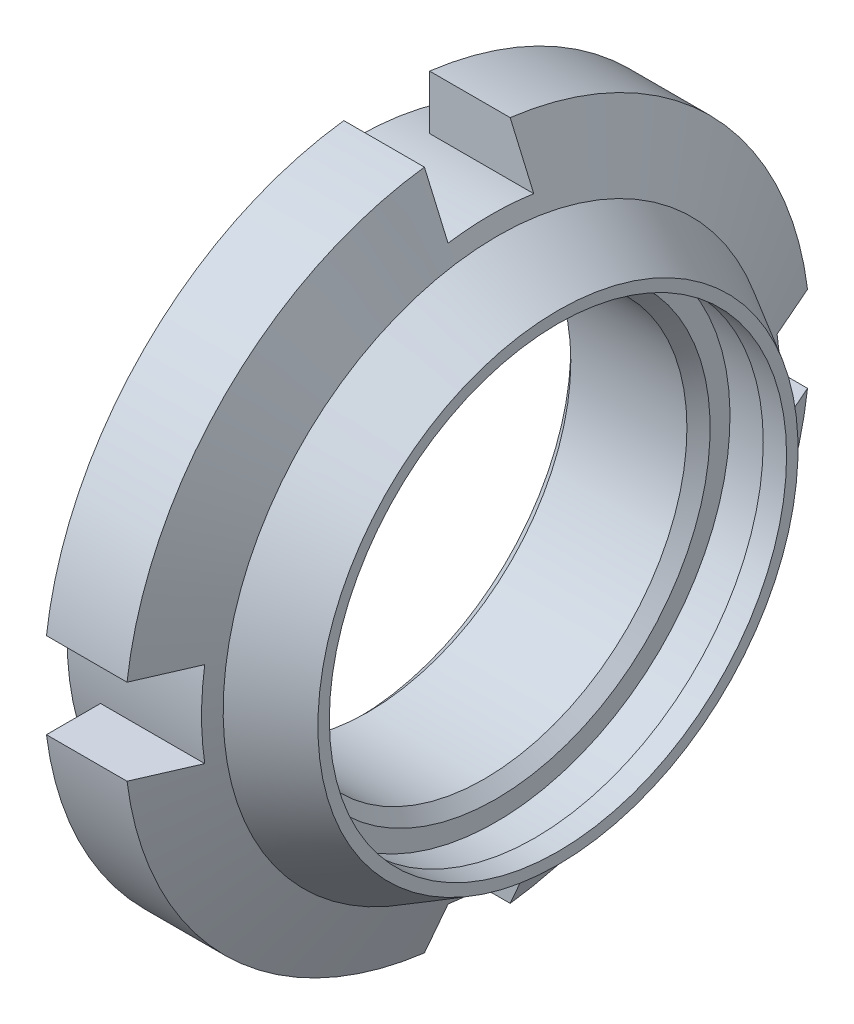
ISO-10303-21;
HEADER;
FILE_DESCRIPTION(('STEP AP214'),'2;1');
FILE_NAME('part.step','',(''),(''),'','','');
FILE_SCHEMA(('AUTOMOTIVE_DESIGN { 1 0 10303 214 1 1 1 1 }'));
ENDSEC;
DATA;
#1=APPLICATION_CONTEXT('core data for automotive mechanical design processes');
#2=APPLICATION_PROTOCOL_DEFINITION('international standard','automotive_design',2000,#1);
#3=PRODUCT_CONTEXT('',#1,'mechanical');
#4=PRODUCT('Part','Part','',(#3));
#5=PRODUCT_RELATED_PRODUCT_CATEGORY('part','',(#4));
#6=PRODUCT_DEFINITION_FORMATION('','',#4);
#7=PRODUCT_DEFINITION_CONTEXT('part definition',#1,'design');
#8=PRODUCT_DEFINITION('design','',#6,#7);
#9=PRODUCT_DEFINITION_SHAPE('','',#8);
#10=(LENGTH_UNIT() NAMED_UNIT(*) SI_UNIT(.MILLI.,.METRE.));
#11=(NAMED_UNIT(*) PLANE_ANGLE_UNIT() SI_UNIT($,.RADIAN.));
#12=(NAMED_UNIT(*) SI_UNIT($,.STERADIAN.) SOLID_ANGLE_UNIT());
#13=UNCERTAINTY_MEASURE_WITH_UNIT(LENGTH_MEASURE(1.E-05),#10,'distance_accuracy_value','');
#14=(GEOMETRIC_REPRESENTATION_CONTEXT(3) GLOBAL_UNCERTAINTY_ASSIGNED_CONTEXT((#13)) GLOBAL_UNIT_ASSIGNED_CONTEXT((#10,
#11,#12)) REPRESENTATION_CONTEXT('',''));
#15=CARTESIAN_POINT('',(0.,0.,0.));
#16=DIRECTION('',(0.,0.,1.));
#17=DIRECTION('',(1.,0.,0.));
#18=AXIS2_PLACEMENT_3D('',#15,#16,#17);
#19=CARTESIAN_POINT('',(0.,6.75,0.));
#20=DIRECTION('',(-1.,0.,0.));
#21=DIRECTION('',(0.,0.,1.));
#22=AXIS2_PLACEMENT_3D('',#19,#20,#21);
#23=PLANE('',#22);
#24=CARTESIAN_POINT('',(0.,0.,0.));
#25=DIRECTION('',(1.,0.,0.));
#26=DIRECTION('',(0.,1.,0.));
#27=AXIS2_PLACEMENT_3D('',#24,#25,#26);
#28=CIRCLE('',#27,10.);
#29=CARTESIAN_POINT('',(0.,10.,0.));
#30=VERTEX_POINT('',#29);
#31=EDGE_CURVE('E9',#30,#30,#28,.T.);
#32=ORIENTED_EDGE('',*,*,#31,.T.);
#33=EDGE_LOOP('',(#32));
#34=FACE_BOUND('',#33,.T.);
#35=CARTESIAN_POINT('',(0.,0.,0.));
#36=DIRECTION('',(-1.,0.,0.));
#37=DIRECTION('',(0.,1.,0.));
#38=AXIS2_PLACEMENT_3D('',#35,#36,#37);
#39=CIRCLE('',#38,13.5);
#40=CARTESIAN_POINT('',(0.,13.5,0.));
#41=VERTEX_POINT('',#40);
#42=EDGE_CURVE('E26',#41,#41,#39,.T.);
#43=ORIENTED_EDGE('',*,*,#42,.T.);
#44=EDGE_LOOP('',(#43));
#45=FACE_BOUND('',#44,.T.);
#46=ADVANCED_FACE('F15',(#34,#45),#23,.T.);
#47=CARTESIAN_POINT('',(1.41,14.75,0.));
#48=DIRECTION('',(-1.,0.,0.));
#49=DIRECTION('',(0.,0.,1.));
#50=AXIS2_PLACEMENT_3D('',#47,#48,#49);
#51=PLANE('',#50);
#52=DIRECTION('',(0.,1.,0.));
#53=VECTOR('',#52,1.);
#54=CARTESIAN_POINT('',(1.41,0.699485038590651,-2.));
#55=LINE('',#54,#53);
#56=CARTESIAN_POINT('',(1.41,-15.8745078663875,-2.));
#57=VERTEX_POINT('',#56);
#58=CARTESIAN_POINT('',(1.41,-13.3510299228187,-2.));
#59=VERTEX_POINT('',#58);
#60=EDGE_CURVE('E186',#57,#59,#55,.T.);
#61=ORIENTED_EDGE('',*,*,#60,.T.);
#62=CARTESIAN_POINT('',(1.41,0.,0.));
#63=DIRECTION('',(-1.,0.,0.));
#64=DIRECTION('',(0.,1.,0.));
#65=AXIS2_PLACEMENT_3D('',#62,#63,#64);
#66=CIRCLE('',#65,13.5);
#67=CARTESIAN_POINT('',(1.41,-2.,-13.3510299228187));
#68=VERTEX_POINT('',#67);
#69=EDGE_CURVE('E383',#68,#59,#66,.T.);
#70=ORIENTED_EDGE('',*,*,#69,.F.);
#71=DIRECTION('',(0.,0.,-1.));
#72=VECTOR('',#71,1.);
#73=CARTESIAN_POINT('',(1.41,-2.,-7.93725393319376));
#74=LINE('',#73,#72);
#75=CARTESIAN_POINT('',(1.41,-2.,-15.8745078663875));
#76=VERTEX_POINT('',#75);
#77=EDGE_CURVE('E190',#68,#76,#74,.T.);
#78=ORIENTED_EDGE('',*,*,#77,.T.);
#79=CARTESIAN_POINT('',(1.41,0.,0.));
#80=DIRECTION('',(-1.,0.,0.));
#81=DIRECTION('',(0.,1.,0.));
#82=AXIS2_PLACEMENT_3D('',#79,#80,#81);
#83=CIRCLE('',#82,16.);
#84=EDGE_CURVE('E373',#76,#57,#83,.T.);
#85=ORIENTED_EDGE('',*,*,#84,.T.);
#86=EDGE_LOOP('',(#61,#70,#78,#85));
#87=FACE_BOUND('',#86,.T.);
#88=ADVANCED_FACE('F253',(#87),#51,.T.);
#89=CARTESIAN_POINT('',(9.4,5.6,0.));
#90=DIRECTION('',(1.,0.,0.));
#91=DIRECTION('',(0.,0.,-1.));
#92=AXIS2_PLACEMENT_3D('',#89,#90,#91);
#93=PLANE('',#92);
#94=CARTESIAN_POINT('',(9.4,0.,0.));
#95=DIRECTION('',(-1.,0.,0.));
#96=DIRECTION('',(0.,1.,0.));
#97=AXIS2_PLACEMENT_3D('',#94,#95,#96);
#98=CIRCLE('',#97,10.6666666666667);
#99=CARTESIAN_POINT('',(9.4,10.6666666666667,0.));
#100=VERTEX_POINT('',#99);
#101=EDGE_CURVE('E364',#100,#100,#98,.T.);
#102=ORIENTED_EDGE('',*,*,#101,.T.);
#103=EDGE_LOOP('',(#102));
#104=FACE_BOUND('',#103,.T.);
#105=CARTESIAN_POINT('',(9.4,0.,0.));
#106=DIRECTION('',(-1.,0.,0.));
#107=DIRECTION('',(0.,1.,0.));
#108=AXIS2_PLACEMENT_3D('',#105,#106,#107);
#109=CIRCLE('',#108,11.2);
#110=CARTESIAN_POINT('',(9.4,11.2,0.));
#111=VERTEX_POINT('',#110);
#112=EDGE_CURVE('E465',#111,#111,#109,.T.);
#113=ORIENTED_EDGE('',*,*,#112,.F.);
#114=EDGE_LOOP('',(#113));
#115=FACE_BOUND('',#114,.T.);
#116=ADVANCED_FACE('F259',(#104,#115),#93,.T.);
#117=CARTESIAN_POINT('',(6.5,10.4634146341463,0.));
#118=DIRECTION('',(1.,0.,0.));
#119=DIRECTION('',(0.,0.,-1.));
#120=AXIS2_PLACEMENT_3D('',#117,#118,#119);
#121=PLANE('',#120);
#122=CARTESIAN_POINT('',(6.5,0.,0.));
#123=DIRECTION('',(-1.,0.,0.));
#124=DIRECTION('',(0.,1.,0.));
#125=AXIS2_PLACEMENT_3D('',#122,#123,#124);
#126=CIRCLE('',#125,10.);
#127=CARTESIAN_POINT('',(6.5,10.,0.));
#128=VERTEX_POINT('',#127);
#129=EDGE_CURVE('E169',#128,#128,#126,.T.);
#130=ORIENTED_EDGE('',*,*,#129,.T.);
#131=EDGE_LOOP('',(#130));
#132=FACE_BOUND('',#131,.T.);
#133=CARTESIAN_POINT('',(6.5,0.,0.));
#134=DIRECTION('',(-1.,0.,0.));
#135=DIRECTION('',(0.,1.,0.));
#136=AXIS2_PLACEMENT_3D('',#133,#134,#135);
#137=CIRCLE('',#136,10.9268292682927);
#138=CARTESIAN_POINT('',(6.5,10.9268292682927,0.));
#139=VERTEX_POINT('',#138);
#140=EDGE_CURVE('E460',#139,#139,#137,.T.);
#141=ORIENTED_EDGE('',*,*,#140,.F.);
#142=EDGE_LOOP('',(#141));
#143=FACE_BOUND('',#142,.T.);
#144=ADVANCED_FACE('F266',(#132,#143),#121,.T.);
#145=CARTESIAN_POINT('',(8.31111111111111,10.7967479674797,0.));
#146=DIRECTION('',(-1.,0.,0.));
#147=DIRECTION('',(0.,0.,1.));
#148=AXIS2_PLACEMENT_3D('',#145,#146,#147);
#149=PLANE('',#148);
#150=CARTESIAN_POINT('',(8.31111111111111,0.,0.));
#151=DIRECTION('',(-1.,0.,0.));
#152=DIRECTION('',(0.,1.,0.));
#153=AXIS2_PLACEMENT_3D('',#150,#151,#152);
#154=CIRCLE('',#153,10.6666666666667);
#155=CARTESIAN_POINT('',(8.31111111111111,10.6666666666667,0.));
#156=VERTEX_POINT('',#155);
#157=EDGE_CURVE('E393',#156,#156,#154,.T.);
#158=ORIENTED_EDGE('',*,*,#157,.F.);
#159=EDGE_LOOP('',(#158));
#160=FACE_BOUND('',#159,.T.);
#161=CARTESIAN_POINT('',(8.31111111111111,0.,0.));
#162=DIRECTION('',(-1.,0.,0.));
#163=DIRECTION('',(0.,1.,0.));
#164=AXIS2_PLACEMENT_3D('',#161,#162,#163);
#165=CIRCLE('',#164,10.9268292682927);
#166=CARTESIAN_POINT('',(8.31111111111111,10.9268292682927,0.));
#167=VERTEX_POINT('',#166);
#168=EDGE_CURVE('E161',#167,#167,#165,.T.);
#169=ORIENTED_EDGE('',*,*,#168,.T.);
#170=EDGE_LOOP('',(#169));
#171=FACE_BOUND('',#170,.T.);
#172=ADVANCED_FACE('F270',(#160,#171),#149,.T.);
#173=CARTESIAN_POINT('',(1.41,14.75,0.));
#174=DIRECTION('',(-1.,0.,0.));
#175=DIRECTION('',(0.,0.,1.));
#176=AXIS2_PLACEMENT_3D('',#173,#174,#175);
#177=PLANE('',#176);
#178=DIRECTION('',(0.,-1.,0.));
#179=VECTOR('',#178,1.);
#180=CARTESIAN_POINT('',(1.41,-0.56225393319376,2.));
#181=LINE('',#180,#179);
#182=CARTESIAN_POINT('',(1.41,-13.3510299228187,2.));
#183=VERTEX_POINT('',#182);
#184=CARTESIAN_POINT('',(1.41,-15.8745078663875,2.));
#185=VERTEX_POINT('',#184);
#186=EDGE_CURVE('E135',#183,#185,#181,.T.);
#187=ORIENTED_EDGE('',*,*,#186,.T.);
#188=CARTESIAN_POINT('',(1.41,0.,0.));
#189=DIRECTION('',(-1.,0.,0.));
#190=DIRECTION('',(0.,1.,0.));
#191=AXIS2_PLACEMENT_3D('',#188,#189,#190);
#192=CIRCLE('',#191,16.);
#193=CARTESIAN_POINT('',(1.41,-2.,15.8745078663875));
#194=VERTEX_POINT('',#193);
#195=EDGE_CURVE('E148',#185,#194,#192,.T.);
#196=ORIENTED_EDGE('',*,*,#195,.T.);
#197=DIRECTION('',(0.,0.,-1.));
#198=VECTOR('',#197,1.);
#199=CARTESIAN_POINT('',(1.41,-2.,6.67551496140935));
#200=LINE('',#199,#198);
#201=CARTESIAN_POINT('',(1.41,-2.,13.3510299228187));
#202=VERTEX_POINT('',#201);
#203=EDGE_CURVE('E155',#194,#202,#200,.T.);
#204=ORIENTED_EDGE('',*,*,#203,.T.);
#205=CARTESIAN_POINT('',(1.41,0.,0.));
#206=DIRECTION('',(-1.,0.,0.));
#207=DIRECTION('',(0.,1.,0.));
#208=AXIS2_PLACEMENT_3D('',#205,#206,#207);
#209=CIRCLE('',#208,13.5);
#210=EDGE_CURVE('E159',#183,#202,#209,.T.);
#211=ORIENTED_EDGE('',*,*,#210,.F.);
#212=EDGE_LOOP('',(#187,#196,#204,#211));
#213=FACE_BOUND('',#212,.T.);
#214=ADVANCED_FACE('F157',(#213),#177,.T.);
#215=CARTESIAN_POINT('',(1.41,14.75,0.));
#216=DIRECTION('',(-1.,0.,0.));
#217=DIRECTION('',(0.,0.,1.));
#218=AXIS2_PLACEMENT_3D('',#215,#216,#217);
#219=PLANE('',#218);
#220=DIRECTION('',(0.,0.,1.));
#221=VECTOR('',#220,1.);
#222=CARTESIAN_POINT('',(1.41,2.,-6.67551496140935));
#223=LINE('',#222,#221);
#224=CARTESIAN_POINT('',(1.41,2.,-15.8745078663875));
#225=VERTEX_POINT('',#224);
#226=CARTESIAN_POINT('',(1.41,2.,-13.3510299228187));
#227=VERTEX_POINT('',#226);
#228=EDGE_CURVE('E381',#225,#227,#223,.T.);
#229=ORIENTED_EDGE('',*,*,#228,.T.);
#230=CARTESIAN_POINT('',(1.41,0.,0.));
#231=DIRECTION('',(-1.,0.,0.));
#232=DIRECTION('',(0.,1.,0.));
#233=AXIS2_PLACEMENT_3D('',#230,#231,#232);
#234=CIRCLE('',#233,13.5);
#235=CARTESIAN_POINT('',(1.41,13.3510299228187,-2.));
#236=VERTEX_POINT('',#235);
#237=EDGE_CURVE('E208',#236,#227,#234,.T.);
#238=ORIENTED_EDGE('',*,*,#237,.F.);
#239=DIRECTION('',(0.,1.,0.));
#240=VECTOR('',#239,1.);
#241=CARTESIAN_POINT('',(1.41,15.3122539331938,-2.));
#242=LINE('',#241,#240);
#243=CARTESIAN_POINT('',(1.41,15.8745078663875,-2.));
#244=VERTEX_POINT('',#243);
#245=EDGE_CURVE('E377',#236,#244,#242,.T.);
#246=ORIENTED_EDGE('',*,*,#245,.T.);
#247=CARTESIAN_POINT('',(1.41,0.,0.));
#248=DIRECTION('',(-1.,0.,0.));
#249=DIRECTION('',(0.,1.,0.));
#250=AXIS2_PLACEMENT_3D('',#247,#248,#249);
#251=CIRCLE('',#250,16.);
#252=EDGE_CURVE('E382',#244,#225,#251,.T.);
#253=ORIENTED_EDGE('',*,*,#252,.T.);
#254=EDGE_LOOP('',(#229,#238,#246,#253));
#255=FACE_BOUND('',#254,.T.);
#256=ADVANCED_FACE('F277',(#255),#219,.T.);
#257=CARTESIAN_POINT('',(1.41,14.75,0.));
#258=DIRECTION('',(-1.,0.,0.));
#259=DIRECTION('',(0.,0.,1.));
#260=AXIS2_PLACEMENT_3D('',#257,#258,#259);
#261=PLANE('',#260);
#262=DIRECTION('',(0.,0.,1.));
#263=VECTOR('',#262,1.);
#264=CARTESIAN_POINT('',(1.41,2.,7.93725393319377));
#265=LINE('',#264,#263);
#266=CARTESIAN_POINT('',(1.41,2.,13.3510299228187));
#267=VERTEX_POINT('',#266);
#268=CARTESIAN_POINT('',(1.41,2.,15.8745078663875));
#269=VERTEX_POINT('',#268);
#270=EDGE_CURVE('E401',#267,#269,#265,.T.);
#271=ORIENTED_EDGE('',*,*,#270,.T.);
#272=CARTESIAN_POINT('',(1.41,0.,0.));
#273=DIRECTION('',(-1.,0.,0.));
#274=DIRECTION('',(0.,1.,0.));
#275=AXIS2_PLACEMENT_3D('',#272,#273,#274);
#276=CIRCLE('',#275,16.);
#277=CARTESIAN_POINT('',(1.41,15.8745078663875,2.));
#278=VERTEX_POINT('',#277);
#279=EDGE_CURVE('E442',#269,#278,#276,.T.);
#280=ORIENTED_EDGE('',*,*,#279,.T.);
#281=DIRECTION('',(0.,-1.,0.));
#282=VECTOR('',#281,1.);
#283=CARTESIAN_POINT('',(1.41,14.0505149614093,2.));
#284=LINE('',#283,#282);
#285=CARTESIAN_POINT('',(1.41,13.3510299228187,2.));
#286=VERTEX_POINT('',#285);
#287=EDGE_CURVE('E498',#278,#286,#284,.T.);
#288=ORIENTED_EDGE('',*,*,#287,.T.);
#289=CARTESIAN_POINT('',(1.41,0.,0.));
#290=DIRECTION('',(-1.,0.,0.));
#291=DIRECTION('',(0.,1.,0.));
#292=AXIS2_PLACEMENT_3D('',#289,#290,#291);
#293=CIRCLE('',#292,13.5);
#294=EDGE_CURVE('E389',#267,#286,#293,.T.);
#295=ORIENTED_EDGE('',*,*,#294,.F.);
#296=EDGE_LOOP('',(#271,#280,#288,#295));
#297=FACE_BOUND('',#296,.T.);
#298=ADVANCED_FACE('F280',(#297),#261,.T.);
#299=CARTESIAN_POINT('',(3.29,0.,0.));
#300=DIRECTION('',(-1.,0.,0.));
#301=DIRECTION('',(0.,0.,1.));
#302=AXIS2_PLACEMENT_3D('',#299,#300,#301);
#303=CYLINDRICAL_SURFACE('',#302,16.);
#304=DIRECTION('',(-1.,0.,0.));
#305=VECTOR('',#304,1.);
#306=CARTESIAN_POINT('',(3.29,-15.8745078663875,-2.));
#307=LINE('',#306,#305);
#308=CARTESIAN_POINT('',(5.17,-15.8745078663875,-2.));
#309=VERTEX_POINT('',#308);
#310=EDGE_CURVE('E459',#309,#57,#307,.T.);
#311=ORIENTED_EDGE('',*,*,#310,.T.);
#312=ORIENTED_EDGE('',*,*,#84,.F.);
#313=DIRECTION('',(1.,0.,0.));
#314=VECTOR('',#313,1.);
#315=CARTESIAN_POINT('',(3.29,-2.,-15.8745078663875));
#316=LINE('',#315,#314);
#317=CARTESIAN_POINT('',(5.17000000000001,-2.,-15.8745078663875));
#318=VERTEX_POINT('',#317);
#319=EDGE_CURVE('E331',#76,#318,#316,.T.);
#320=ORIENTED_EDGE('',*,*,#319,.T.);
#321=CARTESIAN_POINT('',(5.17,0.,0.));
#322=DIRECTION('',(-1.,0.,0.));
#323=DIRECTION('',(0.,1.,0.));
#324=AXIS2_PLACEMENT_3D('',#321,#322,#323);
#325=CIRCLE('',#324,16.);
#326=EDGE_CURVE('E143',#318,#309,#325,.T.);
#327=ORIENTED_EDGE('',*,*,#326,.T.);
#328=EDGE_LOOP('',(#311,#312,#320,#327));
#329=FACE_BOUND('',#328,.T.);
#330=ADVANCED_FACE('F284',(#329),#303,.T.);
#331=CARTESIAN_POINT('',(3.29,0.,0.));
#332=DIRECTION('',(-1.,0.,0.));
#333=DIRECTION('',(0.,0.,1.));
#334=AXIS2_PLACEMENT_3D('',#331,#332,#333);
#335=CYLINDRICAL_SURFACE('',#334,16.);
#336=DIRECTION('',(1.,0.,0.));
#337=VECTOR('',#336,1.);
#338=CARTESIAN_POINT('',(3.29,-15.8745078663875,2.));
#339=LINE('',#338,#337);
#340=CARTESIAN_POINT('',(5.17000000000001,-15.8745078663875,2.));
#341=VERTEX_POINT('',#340);
#342=EDGE_CURVE('E130',#185,#341,#339,.T.);
#343=ORIENTED_EDGE('',*,*,#342,.T.);
#344=CARTESIAN_POINT('',(5.17,0.,0.));
#345=DIRECTION('',(-1.,0.,0.));
#346=DIRECTION('',(0.,1.,0.));
#347=AXIS2_PLACEMENT_3D('',#344,#345,#346);
#348=CIRCLE('',#347,16.);
#349=CARTESIAN_POINT('',(5.17,-2.,15.8745078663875));
#350=VERTEX_POINT('',#349);
#351=EDGE_CURVE('E144',#341,#350,#348,.T.);
#352=ORIENTED_EDGE('',*,*,#351,.T.);
#353=DIRECTION('',(-1.,0.,0.));
#354=VECTOR('',#353,1.);
#355=CARTESIAN_POINT('',(3.29,-2.,15.8745078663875));
#356=LINE('',#355,#354);
#357=EDGE_CURVE('E151',#350,#194,#356,.T.);
#358=ORIENTED_EDGE('',*,*,#357,.T.);
#359=ORIENTED_EDGE('',*,*,#195,.F.);
#360=EDGE_LOOP('',(#343,#352,#358,#359));
#361=FACE_BOUND('',#360,.T.);
#362=ADVANCED_FACE('F149',(#361),#335,.T.);
#363=CARTESIAN_POINT('',(3.29,0.,0.));
#364=DIRECTION('',(-1.,0.,0.));
#365=DIRECTION('',(0.,0.,1.));
#366=AXIS2_PLACEMENT_3D('',#363,#364,#365);
#367=CYLINDRICAL_SURFACE('',#366,16.);
#368=DIRECTION('',(-1.,0.,0.));
#369=VECTOR('',#368,1.);
#370=CARTESIAN_POINT('',(3.29,2.,-15.8745078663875));
#371=LINE('',#370,#369);
#372=CARTESIAN_POINT('',(5.17,2.,-15.8745078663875));
#373=VERTEX_POINT('',#372);
#374=EDGE_CURVE('E193',#373,#225,#371,.T.);
#375=ORIENTED_EDGE('',*,*,#374,.T.);
#376=ORIENTED_EDGE('',*,*,#252,.F.);
#377=DIRECTION('',(1.,0.,0.));
#378=VECTOR('',#377,1.);
#379=CARTESIAN_POINT('',(3.29,15.8745078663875,-2.));
#380=LINE('',#379,#378);
#381=CARTESIAN_POINT('',(5.17,15.8745078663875,-2.));
#382=VERTEX_POINT('',#381);
#383=EDGE_CURVE('E453',#244,#382,#380,.T.);
#384=ORIENTED_EDGE('',*,*,#383,.T.);
#385=CARTESIAN_POINT('',(5.17,0.,0.));
#386=DIRECTION('',(-1.,0.,0.));
#387=DIRECTION('',(0.,1.,0.));
#388=AXIS2_PLACEMENT_3D('',#385,#386,#387);
#389=CIRCLE('',#388,16.);
#390=EDGE_CURVE('E360',#382,#373,#389,.T.);
#391=ORIENTED_EDGE('',*,*,#390,.T.);
#392=EDGE_LOOP('',(#375,#376,#384,#391));
#393=FACE_BOUND('',#392,.T.);
#394=ADVANCED_FACE('F291',(#393),#367,.T.);
#395=CARTESIAN_POINT('',(3.29,0.,0.));
#396=DIRECTION('',(-1.,0.,0.));
#397=DIRECTION('',(0.,0.,1.));
#398=AXIS2_PLACEMENT_3D('',#395,#396,#397);
#399=CYLINDRICAL_SURFACE('',#398,16.);
#400=DIRECTION('',(1.,0.,0.));
#401=VECTOR('',#400,1.);
#402=CARTESIAN_POINT('',(3.29,2.,15.8745078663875));
#403=LINE('',#402,#401);
#404=CARTESIAN_POINT('',(5.17,2.,15.8745078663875));
#405=VERTEX_POINT('',#404);
#406=EDGE_CURVE('E207',#269,#405,#403,.T.);
#407=ORIENTED_EDGE('',*,*,#406,.T.);
#408=CARTESIAN_POINT('',(5.17,0.,0.));
#409=DIRECTION('',(-1.,0.,0.));
#410=DIRECTION('',(0.,1.,0.));
#411=AXIS2_PLACEMENT_3D('',#408,#409,#410);
#412=CIRCLE('',#411,16.);
#413=CARTESIAN_POINT('',(5.17,15.8745078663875,2.));
#414=VERTEX_POINT('',#413);
#415=EDGE_CURVE('E203',#405,#414,#412,.T.);
#416=ORIENTED_EDGE('',*,*,#415,.T.);
#417=DIRECTION('',(-1.,0.,0.));
#418=VECTOR('',#417,1.);
#419=CARTESIAN_POINT('',(3.29,15.8745078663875,2.));
#420=LINE('',#419,#418);
#421=EDGE_CURVE('E181',#414,#278,#420,.T.);
#422=ORIENTED_EDGE('',*,*,#421,.T.);
#423=ORIENTED_EDGE('',*,*,#279,.F.);
#424=EDGE_LOOP('',(#407,#416,#422,#423));
#425=FACE_BOUND('',#424,.T.);
#426=ADVANCED_FACE('F294',(#425),#399,.T.);
#427=CARTESIAN_POINT('',(0.,15.8745078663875,-2.));
#428=DIRECTION('',(0.,0.,1.));
#429=DIRECTION('',(1.,0.,0.));
#430=AXIS2_PLACEMENT_3D('',#427,#428,#429);
#431=PLANE('',#430);
#432=CARTESIAN_POINT('',(5.17,15.8745078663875,-2.));
#433=CARTESIAN_POINT('',(5.76833843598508,14.5058418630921,-2.));
#434=CARTESIAN_POINT('',(6.2715625,13.3510299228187,-2.));
#435=(BOUNDED_CURVE() B_SPLINE_CURVE(2,(#432,#433,#434),.UNSPECIFIED.,.F.,
.F.) B_SPLINE_CURVE_WITH_KNOTS((3,3),(0.,2.6838184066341),
.UNSPECIFIED.) CURVE() GEOMETRIC_REPRESENTATION_ITEM() RATIONAL_B_SPLINE_CURVE((1.,
1.00483792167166,1.0023109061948)) REPRESENTATION_ITEM(''));
#436=CARTESIAN_POINT('',(6.2715625,13.3510299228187,-2.));
#437=VERTEX_POINT('',#436);
#438=EDGE_CURVE('E449',#382,#437,#435,.T.);
#439=ORIENTED_EDGE('',*,*,#438,.F.);
#440=ORIENTED_EDGE('',*,*,#383,.F.);
#441=ORIENTED_EDGE('',*,*,#245,.F.);
#442=DIRECTION('',(1.,0.,0.));
#443=VECTOR('',#442,1.);
#444=CARTESIAN_POINT('',(0.,13.3510299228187,-2.));
#445=LINE('',#444,#443);
#446=EDGE_CURVE('E177',#236,#437,#445,.T.);
#447=ORIENTED_EDGE('',*,*,#446,.T.);
#448=EDGE_LOOP('',(#439,#440,#441,#447));
#449=FACE_BOUND('',#448,.T.);
#450=ADVANCED_FACE('F298',(#449),#431,.T.);
#451=CARTESIAN_POINT('',(0.,-15.8745078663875,2.));
#452=DIRECTION('',(0.,0.,-1.));
#453=DIRECTION('',(-1.,0.,0.));
#454=AXIS2_PLACEMENT_3D('',#451,#452,#453);
#455=PLANE('',#454);
#456=CARTESIAN_POINT('',(5.17,-15.8745078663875,2.));
#457=CARTESIAN_POINT('',(5.7683384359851,-14.5058418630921,2.));
#458=CARTESIAN_POINT('',(6.2715625,-13.3510299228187,2.));
#459=(BOUNDED_CURVE() B_SPLINE_CURVE(2,(#456,#457,#458),.UNSPECIFIED.,.F.,
.F.) B_SPLINE_CURVE_WITH_KNOTS((3,3),(0.,2.68381840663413),
.UNSPECIFIED.) CURVE() GEOMETRIC_REPRESENTATION_ITEM() RATIONAL_B_SPLINE_CURVE((1.,
1.00483792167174,1.00231090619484)) REPRESENTATION_ITEM(''));
#460=CARTESIAN_POINT('',(6.2715625,-13.3510299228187,2.));
#461=VERTEX_POINT('',#460);
#462=EDGE_CURVE('E138',#341,#461,#459,.T.);
#463=ORIENTED_EDGE('',*,*,#462,.F.);
#464=ORIENTED_EDGE('',*,*,#342,.F.);
#465=ORIENTED_EDGE('',*,*,#186,.F.);
#466=DIRECTION('',(1.,0.,0.));
#467=VECTOR('',#466,1.);
#468=CARTESIAN_POINT('',(0.,-13.3510299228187,2.));
#469=LINE('',#468,#467);
#470=EDGE_CURVE('E182',#183,#461,#469,.T.);
#471=ORIENTED_EDGE('',*,*,#470,.T.);
#472=EDGE_LOOP('',(#463,#464,#465,#471));
#473=FACE_BOUND('',#472,.T.);
#474=ADVANCED_FACE('F132',(#473),#455,.T.);
#475=CARTESIAN_POINT('',(0.,-2.,13.3510299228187));
#476=DIRECTION('',(0.,1.,0.));
#477=DIRECTION('',(0.,0.,1.));
#478=AXIS2_PLACEMENT_3D('',#475,#476,#477);
#479=PLANE('',#478);
#480=CARTESIAN_POINT('',(6.2715625,-2.,13.3510299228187));
#481=CARTESIAN_POINT('',(5.76833843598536,-2.,14.5058418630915));
#482=CARTESIAN_POINT('',(5.17,-2.,15.8745078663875));
#483=(BOUNDED_CURVE() B_SPLINE_CURVE(2,(#480,#481,#482),.UNSPECIFIED.,.F.,
.F.) B_SPLINE_CURVE_WITH_KNOTS((3,3),(0.842105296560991,3.5259237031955),
.UNSPECIFIED.) CURVE() GEOMETRIC_REPRESENTATION_ITEM() RATIONAL_B_SPLINE_CURVE((1.0023109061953,
1.00483792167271,1.)) REPRESENTATION_ITEM(''));
#484=CARTESIAN_POINT('',(6.2715625,-2.,13.3510299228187));
#485=VERTEX_POINT('',#484);
#486=EDGE_CURVE('E197',#485,#350,#483,.T.);
#487=ORIENTED_EDGE('',*,*,#486,.F.);
#488=DIRECTION('',(1.,0.,0.));
#489=VECTOR('',#488,1.);
#490=CARTESIAN_POINT('',(0.,-2.,13.3510299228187));
#491=LINE('',#490,#489);
#492=EDGE_CURVE('E392',#202,#485,#491,.T.);
#493=ORIENTED_EDGE('',*,*,#492,.F.);
#494=ORIENTED_EDGE('',*,*,#203,.F.);
#495=ORIENTED_EDGE('',*,*,#357,.F.);
#496=EDGE_LOOP('',(#487,#493,#494,#495));
#497=FACE_BOUND('',#496,.T.);
#498=ADVANCED_FACE('F305',(#497),#479,.T.);
#499=CARTESIAN_POINT('',(0.,2.,15.8745078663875));
#500=DIRECTION('',(0.,-1.,0.));
#501=DIRECTION('',(0.,0.,-1.));
#502=AXIS2_PLACEMENT_3D('',#499,#500,#501);
#503=PLANE('',#502);
#504=CARTESIAN_POINT('',(5.17,2.,15.8745078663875));
#505=CARTESIAN_POINT('',(5.76833843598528,2.,14.5058418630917));
#506=CARTESIAN_POINT('',(6.2715625,2.,13.3510299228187));
#507=(BOUNDED_CURVE() B_SPLINE_CURVE(2,(#504,#505,#506),.UNSPECIFIED.,.F.,
.F.) B_SPLINE_CURVE_WITH_KNOTS((3,3),(0.,2.6838184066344),
.UNSPECIFIED.) CURVE() GEOMETRIC_REPRESENTATION_ITEM() RATIONAL_B_SPLINE_CURVE((1.,
1.00483792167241,1.00231090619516)) REPRESENTATION_ITEM(''));
#508=CARTESIAN_POINT('',(6.2715625,2.,13.3510299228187));
#509=VERTEX_POINT('',#508);
#510=EDGE_CURVE('E83',#405,#509,#507,.T.);
#511=ORIENTED_EDGE('',*,*,#510,.F.);
#512=ORIENTED_EDGE('',*,*,#406,.F.);
#513=ORIENTED_EDGE('',*,*,#270,.F.);
#514=DIRECTION('',(1.,0.,0.));
#515=VECTOR('',#514,1.);
#516=CARTESIAN_POINT('',(0.,2.,13.3510299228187));
#517=LINE('',#516,#515);
#518=EDGE_CURVE('E185',#267,#509,#517,.T.);
#519=ORIENTED_EDGE('',*,*,#518,.T.);
#520=EDGE_LOOP('',(#511,#512,#513,#519));
#521=FACE_BOUND('',#520,.T.);
#522=ADVANCED_FACE('F308',(#521),#503,.T.);
#523=CARTESIAN_POINT('',(0.,13.3510299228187,2.));
#524=DIRECTION('',(0.,0.,-1.));
#525=DIRECTION('',(-1.,0.,0.));
#526=AXIS2_PLACEMENT_3D('',#523,#524,#525);
#527=PLANE('',#526);
#528=CARTESIAN_POINT('',(6.2715625,13.3510299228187,2.));
#529=CARTESIAN_POINT('',(5.76833843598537,14.5058418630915,2.));
#530=CARTESIAN_POINT('',(5.17,15.8745078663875,2.));
#531=(BOUNDED_CURVE() B_SPLINE_CURVE(2,(#528,#529,#530),.UNSPECIFIED.,.F.,
.F.) B_SPLINE_CURVE_WITH_KNOTS((3,3),(0.842105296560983,3.5259237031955),
.UNSPECIFIED.) CURVE() GEOMETRIC_REPRESENTATION_ITEM() RATIONAL_B_SPLINE_CURVE((1.0023109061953,
1.00483792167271,1.)) REPRESENTATION_ITEM(''));
#532=CARTESIAN_POINT('',(6.2715625,13.3510299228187,2.));
#533=VERTEX_POINT('',#532);
#534=EDGE_CURVE('E402',#533,#414,#531,.T.);
#535=ORIENTED_EDGE('',*,*,#534,.F.);
#536=DIRECTION('',(1.,0.,0.));
#537=VECTOR('',#536,1.);
#538=CARTESIAN_POINT('',(0.,13.3510299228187,2.));
#539=LINE('',#538,#537);
#540=EDGE_CURVE('E92',#286,#533,#539,.T.);
#541=ORIENTED_EDGE('',*,*,#540,.F.);
#542=ORIENTED_EDGE('',*,*,#287,.F.);
#543=ORIENTED_EDGE('',*,*,#421,.F.);
#544=EDGE_LOOP('',(#535,#541,#542,#543));
#545=FACE_BOUND('',#544,.T.);
#546=ADVANCED_FACE('F312',(#545),#527,.T.);
#547=CARTESIAN_POINT('',(0.,2.,-13.3510299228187));
#548=DIRECTION('',(0.,-1.,0.));
#549=DIRECTION('',(0.,0.,-1.));
#550=AXIS2_PLACEMENT_3D('',#547,#548,#549);
#551=PLANE('',#550);
#552=CARTESIAN_POINT('',(6.2715625,2.,-13.3510299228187));
#553=CARTESIAN_POINT('',(5.76833843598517,2.,-14.5058418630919));
#554=CARTESIAN_POINT('',(5.17,2.,-15.8745078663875));
#555=(BOUNDED_CURVE() B_SPLINE_CURVE(2,(#552,#553,#554),.UNSPECIFIED.,.F.,
.F.) B_SPLINE_CURVE_WITH_KNOTS((3,3),(0.84210529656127,3.5259237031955),
.UNSPECIFIED.) CURVE() GEOMETRIC_REPRESENTATION_ITEM() RATIONAL_B_SPLINE_CURVE((1.00231090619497,
1.00483792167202,1.)) REPRESENTATION_ITEM(''));
#556=CARTESIAN_POINT('',(6.2715625,2.,-13.3510299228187));
#557=VERTEX_POINT('',#556);
#558=EDGE_CURVE('E202',#557,#373,#555,.T.);
#559=ORIENTED_EDGE('',*,*,#558,.F.);
#560=DIRECTION('',(1.,0.,0.));
#561=VECTOR('',#560,1.);
#562=CARTESIAN_POINT('',(0.,2.,-13.3510299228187));
#563=LINE('',#562,#561);
#564=EDGE_CURVE('E212',#227,#557,#563,.T.);
#565=ORIENTED_EDGE('',*,*,#564,.F.);
#566=ORIENTED_EDGE('',*,*,#228,.F.);
#567=ORIENTED_EDGE('',*,*,#374,.F.);
#568=EDGE_LOOP('',(#559,#565,#566,#567));
#569=FACE_BOUND('',#568,.T.);
#570=ADVANCED_FACE('F316',(#569),#551,.T.);
#571=CARTESIAN_POINT('',(0.,-2.,-15.8745078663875));
#572=DIRECTION('',(0.,1.,0.));
#573=DIRECTION('',(0.,0.,1.));
#574=AXIS2_PLACEMENT_3D('',#571,#572,#573);
#575=PLANE('',#574);
#576=CARTESIAN_POINT('',(5.17,-2.,-15.8745078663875));
#577=CARTESIAN_POINT('',(5.76833843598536,-2.,-14.5058418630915));
#578=CARTESIAN_POINT('',(6.2715625,-2.,-13.3510299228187));
#579=(BOUNDED_CURVE() B_SPLINE_CURVE(2,(#576,#577,#578),.UNSPECIFIED.,.F.,
.F.) B_SPLINE_CURVE_WITH_KNOTS((3,3),(0.,2.68381840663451),
.UNSPECIFIED.) CURVE() GEOMETRIC_REPRESENTATION_ITEM() RATIONAL_B_SPLINE_CURVE((1.,
1.00483792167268,1.00231090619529)) REPRESENTATION_ITEM(''));
#580=CARTESIAN_POINT('',(6.2715625,-2.,-13.3510299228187));
#581=VERTEX_POINT('',#580);
#582=EDGE_CURVE('E173',#318,#581,#579,.T.);
#583=ORIENTED_EDGE('',*,*,#582,.F.);
#584=ORIENTED_EDGE('',*,*,#319,.F.);
#585=ORIENTED_EDGE('',*,*,#77,.F.);
#586=DIRECTION('',(1.,0.,0.));
#587=VECTOR('',#586,1.);
#588=CARTESIAN_POINT('',(0.,-2.,-13.3510299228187));
#589=LINE('',#588,#587);
#590=EDGE_CURVE('E333',#68,#581,#589,.T.);
#591=ORIENTED_EDGE('',*,*,#590,.T.);
#592=EDGE_LOOP('',(#583,#584,#585,#591));
#593=FACE_BOUND('',#592,.T.);
#594=ADVANCED_FACE('F319',(#593),#575,.T.);
#595=CARTESIAN_POINT('',(0.,-13.3510299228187,-2.));
#596=DIRECTION('',(0.,0.,1.));
#597=DIRECTION('',(1.,0.,0.));
#598=AXIS2_PLACEMENT_3D('',#595,#596,#597);
#599=PLANE('',#598);
#600=CARTESIAN_POINT('',(6.2715625,-13.3510299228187,-2.));
#601=CARTESIAN_POINT('',(5.76833843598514,-14.505841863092,-2.));
#602=CARTESIAN_POINT('',(5.17,-15.8745078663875,-2.));
#603=(BOUNDED_CURVE() B_SPLINE_CURVE(2,(#600,#601,#602),.UNSPECIFIED.,.F.,
.F.) B_SPLINE_CURVE_WITH_KNOTS((3,3),(0.842105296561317,3.5259237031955),
.UNSPECIFIED.) CURVE() GEOMETRIC_REPRESENTATION_ITEM() RATIONAL_B_SPLINE_CURVE((1.00231090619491,
1.0048379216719,1.)) REPRESENTATION_ITEM(''));
#604=CARTESIAN_POINT('',(6.2715625,-13.3510299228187,-2.));
#605=VERTEX_POINT('',#604);
#606=EDGE_CURVE('E336',#605,#309,#603,.T.);
#607=ORIENTED_EDGE('',*,*,#606,.F.);
#608=DIRECTION('',(1.,0.,0.));
#609=VECTOR('',#608,1.);
#610=CARTESIAN_POINT('',(0.,-13.3510299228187,-2.));
#611=LINE('',#610,#609);
#612=EDGE_CURVE('E35',#59,#605,#611,.T.);
#613=ORIENTED_EDGE('',*,*,#612,.F.);
#614=ORIENTED_EDGE('',*,*,#60,.F.);
#615=ORIENTED_EDGE('',*,*,#310,.F.);
#616=EDGE_LOOP('',(#607,#613,#614,#615));
#617=FACE_BOUND('',#616,.T.);
#618=ADVANCED_FACE('F223',(#617),#599,.T.);
#619=CARTESIAN_POINT('',(8.85555555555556,0.,0.));
#620=DIRECTION('',(-1.,0.,0.));
#621=DIRECTION('',(0.,0.,1.));
#622=AXIS2_PLACEMENT_3D('',#619,#620,#621);
#623=CYLINDRICAL_SURFACE('',#622,10.6666666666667);
#624=ORIENTED_EDGE('',*,*,#101,.F.);
#625=EDGE_LOOP('',(#624));
#626=FACE_BOUND('',#625,.T.);
#627=ORIENTED_EDGE('',*,*,#157,.T.);
#628=EDGE_LOOP('',(#627));
#629=FACE_BOUND('',#628,.T.);
#630=ADVANCED_FACE('F242',(#626,#629),#623,.F.);
#631=CARTESIAN_POINT('',(7.40555555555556,0.,0.));
#632=DIRECTION('',(-1.,0.,0.));
#633=DIRECTION('',(0.,0.,1.));
#634=AXIS2_PLACEMENT_3D('',#631,#632,#633);
#635=CYLINDRICAL_SURFACE('',#634,10.9268292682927);
#636=ORIENTED_EDGE('',*,*,#168,.F.);
#637=EDGE_LOOP('',(#636));
#638=FACE_BOUND('',#637,.T.);
#639=ORIENTED_EDGE('',*,*,#140,.T.);
#640=EDGE_LOOP('',(#639));
#641=FACE_BOUND('',#640,.T.);
#642=ADVANCED_FACE('F221',(#638,#641),#635,.F.);
#643=DIRECTION('',(0.707106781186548,0.707106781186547,0.));
#644=VECTOR('',#643,1.);
#645=CARTESIAN_POINT('',(6.22925,9.72925,0.));
#646=LINE('',#645,#644);
#647=CARTESIAN_POINT('',(-3.50000000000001,0.,0.));
#648=DIRECTION('',(1.,0.,0.));
#649=AXIS1_PLACEMENT('',#647,#648);
#650=SURFACE_OF_REVOLUTION('',#646,#649);
#651=ORIENTED_EDGE('',*,*,#129,.F.);
#652=EDGE_LOOP('',(#651));
#653=FACE_BOUND('',#652,.T.);
#654=CARTESIAN_POINT('',(5.9585,0.,0.));
#655=DIRECTION('',(-1.,0.,0.));
#656=DIRECTION('',(0.,1.,0.));
#657=AXIS2_PLACEMENT_3D('',#654,#655,#656);
#658=CIRCLE('',#657,9.4585);
#659=CARTESIAN_POINT('',(5.9585,9.4585,0.));
#660=VERTEX_POINT('',#659);
#661=EDGE_CURVE('E397',#660,#660,#658,.T.);
#662=ORIENTED_EDGE('',*,*,#661,.T.);
#663=EDGE_LOOP('',(#662));
#664=FACE_BOUND('',#663,.T.);
#665=ADVANCED_FACE('F217',(#653,#664),#650,.F.);
#666=CARTESIAN_POINT('',(3.25,0.,0.));
#667=DIRECTION('',(-1.,0.,0.));
#668=DIRECTION('',(0.,0.,1.));
#669=AXIS2_PLACEMENT_3D('',#666,#667,#668);
#670=CYLINDRICAL_SURFACE('',#669,9.4585);
#671=ORIENTED_EDGE('',*,*,#661,.F.);
#672=EDGE_LOOP('',(#671));
#673=FACE_BOUND('',#672,.T.);
#674=CARTESIAN_POINT('',(0.541499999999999,0.,0.));
#675=DIRECTION('',(-1.,0.,0.));
#676=DIRECTION('',(0.,1.,0.));
#677=AXIS2_PLACEMENT_3D('',#674,#675,#676);
#678=CIRCLE('',#677,9.4585);
#679=CARTESIAN_POINT('',(0.541499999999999,9.4585,0.));
#680=VERTEX_POINT('',#679);
#681=EDGE_CURVE('E464',#680,#680,#678,.T.);
#682=ORIENTED_EDGE('',*,*,#681,.T.);
#683=EDGE_LOOP('',(#682));
#684=FACE_BOUND('',#683,.T.);
#685=ADVANCED_FACE('F17',(#673,#684),#670,.F.);
#686=DIRECTION('',(-0.707106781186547,0.707106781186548,0.));
#687=VECTOR('',#686,1.);
#688=CARTESIAN_POINT('',(0.270749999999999,9.72925,0.));
#689=LINE('',#688,#687);
#690=CARTESIAN_POINT('',(9.99999999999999,0.,0.));
#691=DIRECTION('',(-1.,0.,0.));
#692=AXIS1_PLACEMENT('',#690,#691);
#693=SURFACE_OF_REVOLUTION('',#689,#692);
#694=ORIENTED_EDGE('',*,*,#31,.F.);
#695=EDGE_LOOP('',(#694));
#696=FACE_BOUND('',#695,.T.);
#697=ORIENTED_EDGE('',*,*,#681,.F.);
#698=EDGE_LOOP('',(#697));
#699=FACE_BOUND('',#698,.T.);
#700=ADVANCED_FACE('F225',(#696,#699),#693,.F.);
#701=DIRECTION('',(0.869757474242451,-0.493479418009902,0.));
#702=VECTOR('',#701,1.);
#703=CARTESIAN_POINT('',(7.99,12.,0.));
#704=LINE('',#703,#702);
#705=CARTESIAN_POINT('',(29.14,0.,0.));
#706=DIRECTION('',(-1.,0.,0.));
#707=AXIS1_PLACEMENT('',#705,#706);
#708=SURFACE_OF_REVOLUTION('',#704,#707);
#709=ORIENTED_EDGE('',*,*,#112,.T.);
#710=EDGE_LOOP('',(#709));
#711=FACE_BOUND('',#710,.T.);
#712=CARTESIAN_POINT('',(6.58,0.,0.));
#713=DIRECTION('',(-1.,0.,0.));
#714=DIRECTION('',(0.,1.,0.));
#715=AXIS2_PLACEMENT_3D('',#712,#713,#714);
#716=CIRCLE('',#715,12.8);
#717=CARTESIAN_POINT('',(6.58,12.8,0.));
#718=VERTEX_POINT('',#717);
#719=EDGE_CURVE('E347',#718,#718,#716,.T.);
#720=ORIENTED_EDGE('',*,*,#719,.F.);
#721=EDGE_LOOP('',(#720));
#722=FACE_BOUND('',#721,.T.);
#723=ADVANCED_FACE('F228',(#711,#722),#708,.F.);
#724=DIRECTION('',(0.403217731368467,-0.915104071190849,0.));
#725=VECTOR('',#724,1.);
#726=CARTESIAN_POINT('',(5.875,14.4,0.));
#727=LINE('',#726,#725);
#728=CARTESIAN_POINT('',(12.22,0.,0.));
#729=DIRECTION('',(-1.,0.,0.));
#730=AXIS1_PLACEMENT('',#728,#729);
#731=SURFACE_OF_REVOLUTION('',#727,#730);
#732=ORIENTED_EDGE('',*,*,#719,.T.);
#733=EDGE_LOOP('',(#732));
#734=FACE_BOUND('',#733,.T.);
#735=ORIENTED_EDGE('',*,*,#462,.T.);
#736=CARTESIAN_POINT('',(6.27156249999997,0.,0.));
#737=DIRECTION('',(1.,0.,0.));
#738=DIRECTION('',(0.,-0.988965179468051,0.14814814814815));
#739=AXIS2_PLACEMENT_3D('',#736,#737,#738);
#740=CIRCLE('',#739,13.5000000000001);
#741=EDGE_CURVE('E341',#461,#605,#740,.T.);
#742=ORIENTED_EDGE('',*,*,#741,.T.);
#743=ORIENTED_EDGE('',*,*,#606,.T.);
#744=ORIENTED_EDGE('',*,*,#326,.F.);
#745=ORIENTED_EDGE('',*,*,#582,.T.);
#746=CARTESIAN_POINT('',(6.27156249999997,0.,0.));
#747=DIRECTION('',(1.,0.,0.));
#748=DIRECTION('',(0.,-0.14814814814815,-0.988965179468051));
#749=AXIS2_PLACEMENT_3D('',#746,#747,#748);
#750=CIRCLE('',#749,13.5000000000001);
#751=EDGE_CURVE('E198',#581,#557,#750,.T.);
#752=ORIENTED_EDGE('',*,*,#751,.T.);
#753=ORIENTED_EDGE('',*,*,#558,.T.);
#754=ORIENTED_EDGE('',*,*,#390,.F.);
#755=ORIENTED_EDGE('',*,*,#438,.T.);
#756=CARTESIAN_POINT('',(6.27156249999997,0.,0.));
#757=DIRECTION('',(1.,0.,0.));
#758=DIRECTION('',(0.,0.988965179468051,-0.148148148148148));
#759=AXIS2_PLACEMENT_3D('',#756,#757,#758);
#760=CIRCLE('',#759,13.5000000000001);
#761=EDGE_CURVE('E406',#437,#533,#760,.T.);
#762=ORIENTED_EDGE('',*,*,#761,.T.);
#763=ORIENTED_EDGE('',*,*,#534,.T.);
#764=ORIENTED_EDGE('',*,*,#415,.F.);
#765=ORIENTED_EDGE('',*,*,#510,.T.);
#766=CARTESIAN_POINT('',(6.27156249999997,0.,0.));
#767=DIRECTION('',(1.,0.,0.));
#768=DIRECTION('',(0.,0.14814814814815,0.988965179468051));
#769=AXIS2_PLACEMENT_3D('',#766,#767,#768);
#770=CIRCLE('',#769,13.5000000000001);
#771=EDGE_CURVE('E194',#509,#485,#770,.T.);
#772=ORIENTED_EDGE('',*,*,#771,.T.);
#773=ORIENTED_EDGE('',*,*,#486,.T.);
#774=ORIENTED_EDGE('',*,*,#351,.F.);
#775=EDGE_LOOP('',(#735,#742,#743,#744,#745,#752,#753,#754,#755,#762,#763,#764,#765,#772,#773,#774));
#776=FACE_BOUND('',#775,.T.);
#777=ADVANCED_FACE('F232',(#734,#776),#731,.F.);
#778=CARTESIAN_POINT('',(0.705,0.,0.));
#779=DIRECTION('',(-1.,0.,0.));
#780=DIRECTION('',(0.,0.,1.));
#781=AXIS2_PLACEMENT_3D('',#778,#779,#780);
#782=CYLINDRICAL_SURFACE('',#781,13.5);
#783=ORIENTED_EDGE('',*,*,#42,.F.);
#784=EDGE_LOOP('',(#783));
#785=FACE_BOUND('',#784,.T.);
#786=ORIENTED_EDGE('',*,*,#741,.F.);
#787=ORIENTED_EDGE('',*,*,#470,.F.);
#788=ORIENTED_EDGE('',*,*,#210,.T.);
#789=ORIENTED_EDGE('',*,*,#492,.T.);
#790=ORIENTED_EDGE('',*,*,#771,.F.);
#791=ORIENTED_EDGE('',*,*,#518,.F.);
#792=ORIENTED_EDGE('',*,*,#294,.T.);
#793=ORIENTED_EDGE('',*,*,#540,.T.);
#794=ORIENTED_EDGE('',*,*,#761,.F.);
#795=ORIENTED_EDGE('',*,*,#446,.F.);
#796=ORIENTED_EDGE('',*,*,#237,.T.);
#797=ORIENTED_EDGE('',*,*,#564,.T.);
#798=ORIENTED_EDGE('',*,*,#751,.F.);
#799=ORIENTED_EDGE('',*,*,#590,.F.);
#800=ORIENTED_EDGE('',*,*,#69,.T.);
#801=ORIENTED_EDGE('',*,*,#612,.T.);
#802=EDGE_LOOP('',(#786,#787,#788,#789,#790,#791,#792,#793,#794,#795,#796,#797,#798,#799,#800,#801));
#803=FACE_BOUND('',#802,.T.);
#804=ADVANCED_FACE('F237',(#785,#803),#782,.T.);
#805=CLOSED_SHELL('',(#46,#88,#116,#144,#172,#214,#256,#298,#330,#362,#394,#426,#450,#474,#498,
#522,#546,#570,#594,#618,#630,#642,#665,#685,#700,#723,#777,#804));
#806=MANIFOLD_SOLID_BREP('B1',#805);
#807=ADVANCED_BREP_SHAPE_REPRESENTATION('',(#18,#806),#14);
#808=SHAPE_DEFINITION_REPRESENTATION(#9,#807);
ENDSEC;
END-ISO-10303-21;
